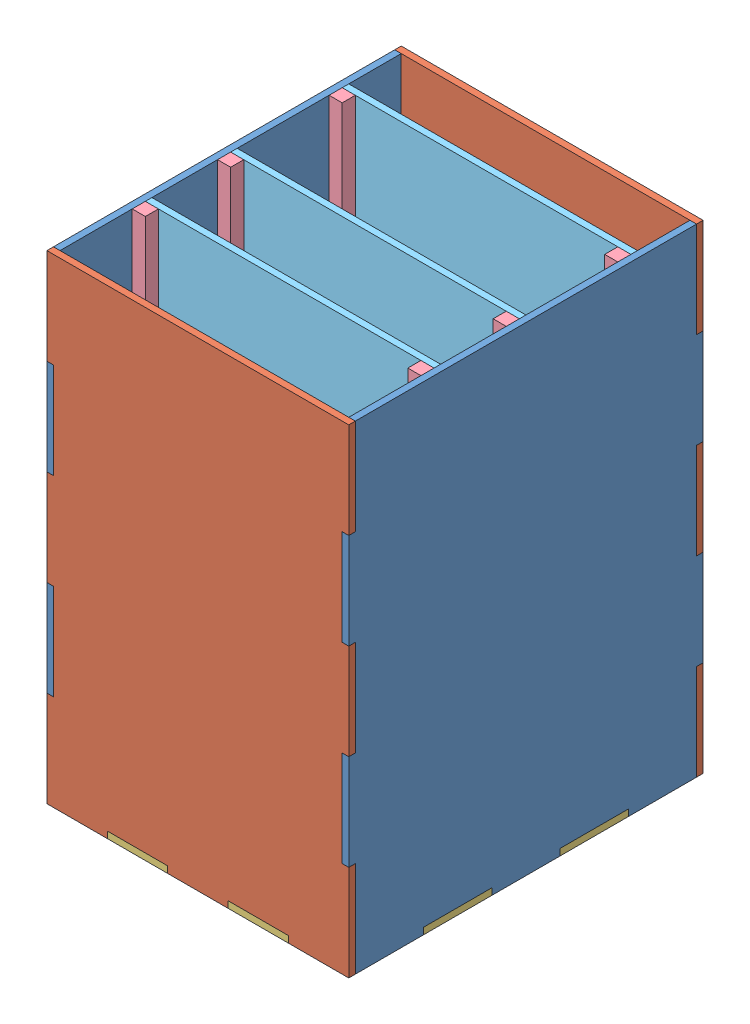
SolidWorks assembly DAQCONTROLTOWER_ASM1.SLDASM, configuration Default (file format 4400). Lengths in mm.
Overall size (146.05 231.78 171.45).
14 component instances, 5 part files, 40 mates.
Components (placement in the parent):
- DAQCONTROLTOWERSIDE-1: DAQCONTROLTOWERSIDE.sldprt [Default] at (-143.4216 -97.0109 28.4673) size (3.17 231.78 171.45)
- DAQCONTROLTOWERTOP-1: DAQCONTROLTOWERTOP.sldprt [Default] at (-286.2966 -97.0109 -142.9827) x (0 -1 0) z (-1 0 0) size (231.78 3.17 146.05)
- DAQCONTROLTOWERTOP-2: DAQCONTROLTOWERTOP.sldprt [Default] at (-286.2966 -97.0109 25.2923) x (0 -1 0) z (-1 0 0) size (231.78 3.17 146.05)
- DAQCONTROLTOWERSIDE-2: DAQCONTROLTOWERSIDE.sldprt [Default] at (-286.2966 -97.0109 28.4673) size (3.17 231.78 171.45)
- DAQCONTROLTOWERBACK-1: DAQCONTROLTOWERBACK.sldprt [Default] at (-286.6564 -328.7859 -142.9827) x (0 0 1) z (0 1 0) size (171.45 146.05 3.17)
- DAQCONTROLTOWERSUPPORTROD-1: DAQCONTROLTOWERSUPPORTROD.sldprt [Default] at (-283.1216 -97.0109 -15.9827) x (1 0 0) z (0 -1 0) size (6.35 6.35 228.6)
- DAQCONTROLTOWERSUPPORTROD-2: DAQCONTROLTOWERSUPPORTROD.sldprt [Default] at (-283.1216 -97.0109 -57.2577) x (1 0 0) z (0 -1 0) size (6.35 6.35 228.6)
- DAQCONTROLTOWERSUPPORTROD-3: DAQCONTROLTOWERSUPPORTROD.sldprt [Default] at (-283.1216 -97.0109 -111.2327) x (1 0 0) z (0 -1 0) size (6.35 6.35 228.6)
- DAQCONTROLTOWERSUPPORTROD-4: DAQCONTROLTOWERSUPPORTROD.sldprt [Default] at (-143.4216 -325.6109 -15.9827) x (-1 0 0) z (0 1 0) size (6.35 6.35 228.6)
- DAQCONTROLTOWERSUPPORTROD-5: DAQCONTROLTOWERSUPPORTROD.sldprt [Default] at (-149.7716 -97.0109 -57.2577) x (1 0 0) z (0 -1 0) size (6.35 6.35 228.6)
- DAQCONTROLTOWERSUPPORTROD-6: DAQCONTROLTOWERSUPPORTROD.sldprt [Default] at (-149.7716 -97.0109 -111.2327) x (1 0 0) z (0 -1 0) size (6.35 6.35 228.6)
- SHELVES-1: SHELVES.sldprt [Default] at (-283.1216 -97.0109 -15.9827) x (1 0 0) z (0 1 0) size (139.7 3.17 215.9)
- SHELVES-2: SHELVES.sldprt [Default] at (-283.1216 -97.0109 -57.2577) x (1 0 0) z (0 1 0) size (139.7 3.17 215.9)
- SHELVES-3: SHELVES.sldprt [Default] at (-283.1216 -97.0109 -111.2327) x (1 0 0) z (0 1 0) size (139.7 3.17 215.9)
Mates (geometry in assembly coordinates):
- Coincident1: coincident aligned: plane of DAQCONTROLTOWERTOP-2 through (-227.8766 -328.7859 25.2923) normal (0 -1 0); plane of DAQCONTROLTOWERBACK-1 through (-143.4216 -328.7859 -106.7877) normal (0 -1 0)
- Coincident2: coincident aligned: plane of DAQCONTROLTOWERTOP-2 through (-140.2466 -143.3659 28.4673) normal (0 0 1); plane of DAQCONTROLTOWERBACK-1 through (-169.4566 -325.6109 28.4673) normal (0 0 1)
- Coincident3: coincident anti-aligned: plane of DAQCONTROLTOWERSIDE-1 through (-143.4216 -143.3659 -139.8077) normal (-1 0 0); plane of DAQCONTROLTOWERBACK-1 through (-143.4216 -325.6109 -7.7277) normal (1 0 0)
- Coincident4: coincident anti-aligned: plane of DAQCONTROLTOWERSIDE-1 through (-143.4216 -282.4309 25.2923) normal (0 0 1); plane of DAQCONTROLTOWERTOP-2 through (-140.2466 -143.3659 25.2923) normal (0 0 -1)
- Coincident5: coincident aligned: plane of DAQCONTROLTOWERSIDE-1 through (-143.4216 -236.0759 28.4673) normal (0 0 1); plane of DAQCONTROLTOWERTOP-2 through (-140.2466 -143.3659 28.4673) normal (0 0 1)
- Coincident6: coincident aligned: plane of DAQCONTROLTOWERSIDE-2 through (-286.2966 -328.7859 25.2923) normal (0 -1 0); plane of DAQCONTROLTOWERBACK-1 through (-143.4216 -328.7859 -106.7877) normal (0 -1 0)
- Coincident7: coincident anti-aligned: plane of DAQCONTROLTOWERTOP-2 through (-140.2466 -143.3659 25.2923) normal (0 0 -1); plane of DAQCONTROLTOWERSIDE-2 through (-286.2966 -282.4309 25.2923) normal (0 0 1)
- Coincident8: coincident anti-aligned: plane of DAQCONTROLTOWERSIDE-2 through (-283.1216 -143.3659 -139.8077) normal (1 0 0); plane of DAQCONTROLTOWERBACK-1 through (-283.1216 -325.6109 25.2923) normal (-1 0 0)
- Coincident9: coincident anti-aligned: plane of DAQCONTROLTOWERSUPPORTROD-1 through (-276.7716 -325.6109 -15.9827) normal (0 0 -1); plane of SHELVES-1 through (-283.1216 -312.9109 -15.9827) normal (0 0 1)
- Coincident10: coincident anti-aligned: plane of DAQCONTROLTOWERSUPPORTROD-2 through (-276.7716 -325.6109 -57.2577) normal (0 0 -1); plane of SHELVES-2 through (-283.1216 -312.9109 -57.2577) normal (0 0 1)
- Coincident11: coincident anti-aligned: plane of DAQCONTROLTOWERSUPPORTROD-3 through (-276.7716 -325.6109 -111.2327) normal (0 0 -1); plane of SHELVES-3 through (-283.1216 -312.9109 -111.2327) normal (0 0 1)
- Coincident12: coincident anti-aligned: plane of DAQCONTROLTOWERTOP-1 through (-140.2466 -143.3659 -139.8077) normal (0 0 1); plane of DAQCONTROLTOWERSIDE-2 through (-286.2966 -236.0759 -139.8077) normal (0 0 -1)
- Coincident13: coincident aligned: plane of DAQCONTROLTOWERTOP-1 through (-286.2966 -97.0109 -142.9827) normal (-1 0 0); plane of DAQCONTROLTOWERSIDE-2 through (-286.2966 -143.3659 -139.8077) normal (-1 0 0)
- Coincident14: coincident aligned: plane of DAQCONTROLTOWERSIDE-2 through (-286.2966 -143.3659 -139.8077) normal (-1 0 0); plane of DAQCONTROLTOWERTOP-2 through (-286.2966 -97.0109 25.2923) normal (-1 0 0)
- Coincident15: coincident anti-aligned: plane of DAQCONTROLTOWERSUPPORTROD-4 through (-149.7716 -97.0109 -15.9827) normal (0 0 -1); plane of SHELVES-1 through (-283.1216 -312.9109 -15.9827) normal (0 0 1)
- Coincident16: coincident aligned: plane of DAQCONTROLTOWERSUPPORTROD-4 through (-143.4216 -325.6109 -15.9827) normal (1 0 0); plane of SHELVES-1 through (-143.4216 -97.0109 -15.9827) normal (1 0 0)
- Coincident17: coincident anti-aligned: plane of DAQCONTROLTOWERSIDE-2 through (-283.1216 -143.3659 -139.8077) normal (1 0 0); plane of SHELVES-1 through (-283.1216 -312.9109 -15.9827) normal (-1 0 0)
- Coincident18: coincident anti-aligned: plane of DAQCONTROLTOWERSUPPORTROD-5 through (-143.4216 -325.6109 -57.2577) normal (0 0 -1); plane of SHELVES-2 through (-283.1216 -312.9109 -57.2577) normal (0 0 1)
- Coincident19: coincident aligned: plane of DAQCONTROLTOWERSUPPORTROD-5 through (-143.4216 -325.6109 -57.2577) normal (1 0 0); plane of SHELVES-2 through (-143.4216 -97.0109 -57.2577) normal (1 0 0)
- Coincident20: coincident anti-aligned: plane of DAQCONTROLTOWERSIDE-2 through (-283.1216 -143.3659 -139.8077) normal (1 0 0); plane of SHELVES-2 through (-283.1216 -312.9109 -57.2577) normal (-1 0 0)
- Coincident21: coincident anti-aligned: plane of DAQCONTROLTOWERSUPPORTROD-6 through (-143.4216 -325.6109 -111.2327) normal (0 0 -1); plane of SHELVES-3 through (-283.1216 -312.9109 -111.2327) normal (0 0 1)
- Coincident22: coincident aligned: plane of DAQCONTROLTOWERSUPPORTROD-6 through (-143.4216 -325.6109 -111.2327) normal (1 0 0); plane of SHELVES-3 through (-143.4216 -97.0109 -111.2327) normal (1 0 0)
- Coincident23: coincident aligned: plane of DAQCONTROLTOWERSUPPORTROD-3 through (-283.1216 -97.0109 -111.2327) normal (-1 0 0); plane of SHELVES-3 through (-283.1216 -312.9109 -111.2327) normal (-1 0 0)
- Coincident24: coincident anti-aligned: plane of DAQCONTROLTOWERSIDE-2 through (-283.1216 -143.3659 -139.8077) normal (1 0 0); plane of DAQCONTROLTOWERSUPPORTROD-2 through (-283.1216 -97.0109 -57.2577) normal (-1 0 0)
- Coincident25: coincident anti-aligned: plane of DAQCONTROLTOWERSIDE-2 through (-283.1216 -143.3659 -139.8077) normal (1 0 0); plane of DAQCONTROLTOWERSUPPORTROD-1 through (-283.1216 -97.0109 -15.9827) normal (-1 0 0)
- Coincident26: coincident aligned: plane of DAQCONTROLTOWERSIDE-2 through (-286.2966 -97.0109 -139.8077) normal (0 1 0); plane of SHELVES-1 through (-283.1216 -97.0109 -15.9827) normal (0 1 0)
- Coincident27: coincident aligned: plane of DAQCONTROLTOWERSUPPORTROD-1 through (-276.7716 -97.0109 -15.9827) normal (0 1 0); plane of SHELVES-1 through (-283.1216 -97.0109 -15.9827) normal (0 1 0)
- Coincident28: coincident aligned: plane of DAQCONTROLTOWERSUPPORTROD-4 through (-143.4216 -97.0109 -15.9827) normal (0 1 0); plane of SHELVES-1 through (-283.1216 -97.0109 -15.9827) normal (0 1 0)
- Coincident29: coincident aligned: plane of DAQCONTROLTOWERSUPPORTROD-2 through (-276.7716 -97.0109 -57.2577) normal (0 1 0); plane of SHELVES-2 through (-283.1216 -97.0109 -57.2577) normal (0 1 0)
- Coincident30: coincident aligned: plane of DAQCONTROLTOWERSUPPORTROD-5 through (-143.4216 -97.0109 -57.2577) normal (0 1 0); plane of SHELVES-2 through (-283.1216 -97.0109 -57.2577) normal (0 1 0)
- Coincident31: coincident aligned: plane of DAQCONTROLTOWERSIDE-2 through (-286.2966 -97.0109 -139.8077) normal (0 1 0); plane of SHELVES-2 through (-283.1216 -97.0109 -57.2577) normal (0 1 0)
- Coincident32: coincident aligned: plane of DAQCONTROLTOWERSUPPORTROD-3 through (-276.7716 -97.0109 -111.2327) normal (0 1 0); plane of SHELVES-3 through (-283.1216 -97.0109 -111.2327) normal (0 1 0)
- Coincident33: coincident aligned: plane of DAQCONTROLTOWERSUPPORTROD-6 through (-143.4216 -97.0109 -111.2327) normal (0 1 0); plane of SHELVES-3 through (-283.1216 -97.0109 -111.2327) normal (0 1 0)
- Coincident34: coincident aligned: plane of DAQCONTROLTOWERSIDE-2 through (-286.2966 -97.0109 -139.8077) normal (0 1 0); plane of DAQCONTROLTOWERSUPPORTROD-6 through (-143.4216 -97.0109 -111.2327) normal (0 1 0)
- Coincident35: coincident aligned: plane of DAQCONTROLTOWERTOP-1 through (-140.2466 -97.0109 -142.9827) normal (0 1 0); plane of DAQCONTROLTOWERSIDE-2 through (-286.2966 -97.0109 -139.8077) normal (0 1 0)
- Coincident36: coincident aligned: plane of DAQCONTROLTOWERSIDE-1 through (-143.4216 -97.0109 -139.8077) normal (0 1 0); plane of DAQCONTROLTOWERTOP-1 through (-140.2466 -97.0109 -142.9827) normal (0 1 0)
- Coincident37: coincident anti-aligned: plane of DAQCONTROLTOWERSIDE-2 through (-283.1216 -143.3659 -139.8077) normal (1 0 0); plane of DAQCONTROLTOWERSUPPORTROD-3 through (-283.1216 -97.0109 -111.2327) normal (-1 0 0)
- Distance1: distance = 44.45 mm aligned: plane of SHELVES-1 through (-283.1216 -312.9109 -19.1577) normal (0 0 -1); plane of DAQCONTROLTOWERTOP-2 through (-140.2466 -143.3659 25.2923) normal (0 0 -1)
- Distance2: distance = 41.275 mm aligned: plane of SHELVES-2 through (-283.1216 -312.9109 -60.4327) normal (0 0 -1); plane of SHELVES-1 through (-283.1216 -312.9109 -19.1577) normal (0 0 -1)
- Distance3: distance = 53.975 mm aligned: plane of SHELVES-3 through (-283.1216 -312.9109 -114.4077) normal (0 0 -1); plane of SHELVES-2 through (-283.1216 -312.9109 -60.4327) normal (0 0 -1)
